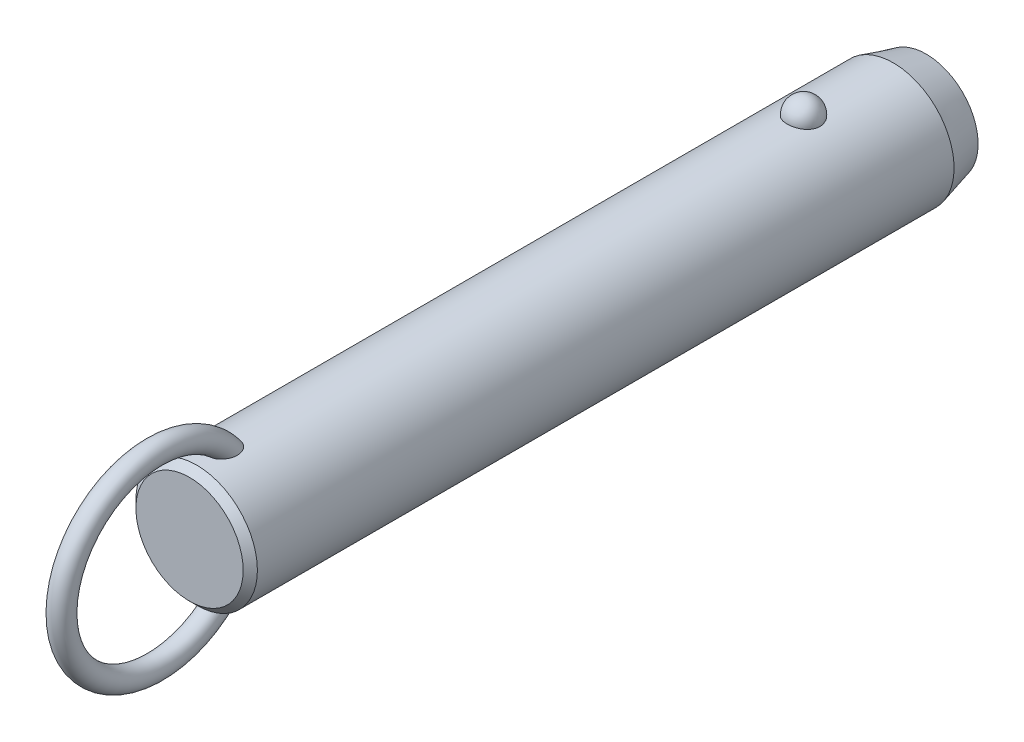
ISO-10303-21;
HEADER;
FILE_DESCRIPTION(('STEP AP214'),'2;1');
FILE_NAME('part.step','',(''),(''),'','','');
FILE_SCHEMA(('AUTOMOTIVE_DESIGN { 1 0 10303 214 1 1 1 1 }'));
ENDSEC;
DATA;
#1=APPLICATION_CONTEXT('core data for automotive mechanical design processes');
#2=APPLICATION_PROTOCOL_DEFINITION('international standard','automotive_design',2000,#1);
#3=PRODUCT_CONTEXT('',#1,'mechanical');
#4=PRODUCT('Part','Part','',(#3));
#5=PRODUCT_RELATED_PRODUCT_CATEGORY('part','',(#4));
#6=PRODUCT_DEFINITION_FORMATION('','',#4);
#7=PRODUCT_DEFINITION_CONTEXT('part definition',#1,'design');
#8=PRODUCT_DEFINITION('design','',#6,#7);
#9=PRODUCT_DEFINITION_SHAPE('','',#8);
#10=(LENGTH_UNIT() NAMED_UNIT(*) SI_UNIT(.MILLI.,.METRE.));
#11=(NAMED_UNIT(*) PLANE_ANGLE_UNIT() SI_UNIT($,.RADIAN.));
#12=(NAMED_UNIT(*) SI_UNIT($,.STERADIAN.) SOLID_ANGLE_UNIT());
#13=UNCERTAINTY_MEASURE_WITH_UNIT(LENGTH_MEASURE(1.E-05),#10,'distance_accuracy_value','');
#14=(GEOMETRIC_REPRESENTATION_CONTEXT(3) GLOBAL_UNCERTAINTY_ASSIGNED_CONTEXT((#13)) GLOBAL_UNIT_ASSIGNED_CONTEXT((#10,
#11,#12)) REPRESENTATION_CONTEXT('',''));
#15=CARTESIAN_POINT('',(0.,0.,0.));
#16=DIRECTION('',(0.,0.,1.));
#17=DIRECTION('',(1.,0.,0.));
#18=AXIS2_PLACEMENT_3D('',#15,#16,#17);
#19=CARTESIAN_POINT('',(0.,0.,96.5));
#20=DIRECTION('',(0.,0.,-1.));
#21=DIRECTION('',(-1.,0.,0.));
#22=AXIS2_PLACEMENT_3D('',#19,#20,#21);
#23=CYLINDRICAL_SURFACE('',#22,11.1);
#24=CARTESIAN_POINT('',(2.9724815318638,10.6945945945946,-3.));
#25=CARTESIAN_POINT('',(2.9724783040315,10.6945972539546,-2.83225059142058));
#26=CARTESIAN_POINT('',(2.95876598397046,10.6984356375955,-2.66445972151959));
#27=CARTESIAN_POINT('',(2.90424529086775,10.7133624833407,-2.33362381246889));
#28=CARTESIAN_POINT('',(2.8634252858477,10.7244540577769,-2.1705808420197));
#29=CARTESIAN_POINT('',(2.75573657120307,10.7526272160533,-1.85396767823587));
#30=CARTESIAN_POINT('',(2.68887937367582,10.7697061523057,-1.70039333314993));
#31=CARTESIAN_POINT('',(2.53079696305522,10.8079438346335,-1.40691598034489));
#32=CARTESIAN_POINT('',(2.43957264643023,10.8291024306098,-1.2670124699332));
#33=CARTESIAN_POINT('',(2.23458150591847,10.8732541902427,-1.00409565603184));
#34=CARTESIAN_POINT('',(2.12071295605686,10.8962553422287,-0.881162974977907));
#35=CARTESIAN_POINT('',(1.87365402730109,10.9414421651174,-0.656352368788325));
#36=CARTESIAN_POINT('',(1.74046358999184,10.9636278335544,-0.554474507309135));
#37=CARTESIAN_POINT('',(1.45872188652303,11.0046495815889,-0.374872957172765));
#38=CARTESIAN_POINT('',(1.31021276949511,11.0234944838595,-0.297085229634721));
#39=CARTESIAN_POINT('',(1.00170030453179,11.0557957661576,-0.167529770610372));
#40=CARTESIAN_POINT('',(0.841698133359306,11.0692526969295,-0.115759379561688));
#41=CARTESIAN_POINT('',(0.517607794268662,11.0890932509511,-0.0403925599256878));
#42=CARTESIAN_POINT('',(0.353633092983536,11.0955916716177,-0.0163383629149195));
#43=CARTESIAN_POINT('',(0.0238420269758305,11.1011989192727,0.00445177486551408));
#44=CARTESIAN_POINT('',(-0.141974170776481,11.1003084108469,0.0011901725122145));
#45=CARTESIAN_POINT('',(-0.46840517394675,11.0912990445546,-0.0323233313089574));
#46=CARTESIAN_POINT('',(-0.629059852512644,11.0832767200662,-0.062214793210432));
#47=CARTESIAN_POINT('',(-0.942937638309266,11.0609962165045,-0.147645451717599));
#48=CARTESIAN_POINT('',(-1.09616062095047,11.0467379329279,-0.203185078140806));
#49=CARTESIAN_POINT('',(-1.39181061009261,11.0134071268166,-0.338752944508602));
#50=CARTESIAN_POINT('',(-1.53417383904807,10.9943086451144,-0.418913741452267));
#51=CARTESIAN_POINT('',(-1.80342160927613,10.9533667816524,-0.601448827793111));
#52=CARTESIAN_POINT('',(-1.9303046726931,10.9315231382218,-0.703825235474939));
#53=CARTESIAN_POINT('',(-2.16747598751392,10.887005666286,-0.930091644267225));
#54=CARTESIAN_POINT('',(-2.27742774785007,10.8643239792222,-1.05433291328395));
#55=CARTESIAN_POINT('',(-2.47517316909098,10.8209886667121,-1.31966633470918));
#56=CARTESIAN_POINT('',(-2.56296538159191,10.8003351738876,-1.46075958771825));
#57=CARTESIAN_POINT('',(-2.71500300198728,10.7631304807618,-1.75753646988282));
#58=CARTESIAN_POINT('',(-2.77898901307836,10.7466250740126,-1.91335887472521));
#59=CARTESIAN_POINT('',(-2.88046189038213,10.7198747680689,-2.2339152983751));
#60=CARTESIAN_POINT('',(-2.91794947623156,10.709629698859,-2.39864907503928));
#61=CARTESIAN_POINT('',(-2.96537819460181,10.6965949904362,-2.73165170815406));
#62=CARTESIAN_POINT('',(-2.97542891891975,10.693775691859,-2.89990378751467));
#63=CARTESIAN_POINT('',(-2.96804271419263,10.6958279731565,-3.235752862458));
#64=CARTESIAN_POINT('',(-2.95060646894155,10.7006993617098,-3.40334987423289));
#65=CARTESIAN_POINT('',(-2.88883358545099,10.71753912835,-3.73233906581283));
#66=CARTESIAN_POINT('',(-2.84462026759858,10.7294749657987,-3.89375610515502));
#67=CARTESIAN_POINT('',(-2.73050447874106,10.7590797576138,-4.20667949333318));
#68=CARTESIAN_POINT('',(-2.66060103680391,10.7767489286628,-4.35818546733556));
#69=CARTESIAN_POINT('',(-2.49642559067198,10.8159599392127,-4.6478542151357));
#70=CARTESIAN_POINT('',(-2.40203047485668,10.8375211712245,-4.78594458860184));
#71=CARTESIAN_POINT('',(-2.19143488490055,10.8820570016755,-5.0441038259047));
#72=CARTESIAN_POINT('',(-2.07523364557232,10.9050316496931,-5.16417205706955));
#73=CARTESIAN_POINT('',(-1.82361254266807,10.9499219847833,-5.38334833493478));
#74=CARTESIAN_POINT('',(-1.68812945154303,10.9718338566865,-5.4823846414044));
#75=CARTESIAN_POINT('',(-1.40191298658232,11.0120611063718,-5.65618873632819));
#76=CARTESIAN_POINT('',(-1.25118062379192,11.0303767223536,-5.73095813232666));
#77=CARTESIAN_POINT('',(-0.940570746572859,11.0611653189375,-5.85334725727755));
#78=CARTESIAN_POINT('',(-0.780821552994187,11.0737044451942,-5.90127578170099));
#79=CARTESIAN_POINT('',(-0.455204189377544,11.0918598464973,-5.96992976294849));
#80=CARTESIAN_POINT('',(-0.289336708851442,11.0974768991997,-5.99065827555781));
#81=CARTESIAN_POINT('',(0.0406846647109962,11.1011307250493,-6.00418773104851));
#82=CARTESIAN_POINT('',(0.204817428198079,11.099299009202,-5.99747318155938));
#83=CARTESIAN_POINT('',(0.529553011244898,11.088551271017,-5.9574031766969));
#84=CARTESIAN_POINT('',(0.690155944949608,11.0796354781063,-5.92404858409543));
#85=CARTESIAN_POINT('',(1.0027760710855,11.0557204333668,-5.83180084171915));
#86=CARTESIAN_POINT('',(1.15482001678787,11.0407414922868,-5.77299291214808));
#87=CARTESIAN_POINT('',(1.44678373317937,11.0062913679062,-5.63147366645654));
#88=CARTESIAN_POINT('',(1.58670279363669,10.9868199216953,-5.54876095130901));
#89=CARTESIAN_POINT('',(1.8527023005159,10.9451315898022,-5.36027644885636));
#90=CARTESIAN_POINT('',(1.97855158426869,10.9228788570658,-5.25418644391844));
#91=CARTESIAN_POINT('',(2.21080872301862,10.8782509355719,-5.02251354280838));
#92=CARTESIAN_POINT('',(2.31721312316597,10.8558757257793,-4.89692718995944));
#93=CARTESIAN_POINT('',(2.50945517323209,10.8130715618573,-4.62745408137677));
#94=CARTESIAN_POINT('',(2.59493284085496,10.7926798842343,-4.48330448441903));
#95=CARTESIAN_POINT('',(2.740862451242,10.7565495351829,-4.18236358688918));
#96=CARTESIAN_POINT('',(2.80132490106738,10.7408089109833,-4.02557762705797));
#97=CARTESIAN_POINT('',(2.88959070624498,10.7173718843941,-3.72475308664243));
#98=CARTESIAN_POINT('',(2.92062102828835,10.7088950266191,-3.58171216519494));
#99=CARTESIAN_POINT('',(2.96206765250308,10.6975052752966,-3.29245795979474));
#100=CARTESIAN_POINT('',(2.97248434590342,10.6945922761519,-3.14624473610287));
#101=CARTESIAN_POINT('',(2.9724815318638,10.6945945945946,-3.));
#102=B_SPLINE_CURVE_WITH_KNOTS('',3,(#24,#25,#26,#27,#28,#29,#30,#31,#32,#33,#34,#35,#36,#37,
#38,#39,#40,#41,#42,#43,#44,#45,#46,#47,#48,#49,#50,#51,#52,#53,#54,#55,#56,#57,#58,#59,#60,#61,
#62,#63,#64,#65,#66,#67,#68,#69,#70,#71,#72,#73,#74,#75,#76,#77,#78,#79,#80,#81,#82,#83,#84,#85,
#86,#87,#88,#89,#90,#91,#92,#93,#94,#95,#96,#97,#98,#99,#100,#101),.UNSPECIFIED.,.T.,.F.,(4,2,2,
2,2,2,2,2,2,2,2,2,2,2,2,2,2,2,2,2,2,2,2,2,2,2,2,2,2,2,2,2,2,2,2,2,2,2,4),(0.,0.502722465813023,
1.00566079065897,1.5083769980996,2.01107471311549,2.51608392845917,3.02109467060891,
3.52475118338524,4.02835620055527,4.52351860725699,5.01863647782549,5.50715297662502,
5.99567766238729,6.48688002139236,6.97812923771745,7.47814366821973,7.97819077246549,
8.48353712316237,8.98886974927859,9.49218093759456,9.99547960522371,10.4964777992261,
10.997494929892,11.5010810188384,12.0046847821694,12.5099796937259,13.0152411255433,
13.5145635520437,14.0138298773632,14.5043200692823,14.9947943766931,15.4836390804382,
15.9725123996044,16.4685040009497,16.9645836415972,17.4686765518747,17.972557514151,
18.410841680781,18.849117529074),.UNSPECIFIED.);
#103=CARTESIAN_POINT('',(2.9724815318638,10.6945945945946,-3.));
#104=VERTEX_POINT('',#103);
#105=EDGE_CURVE('E41',#104,#104,#102,.T.);
#106=ORIENTED_EDGE('',*,*,#105,.T.);
#107=EDGE_LOOP('',(#106));
#108=FACE_BOUND('',#107,.T.);
#109=CARTESIAN_POINT('',(0.,0.,107.9));
#110=DIRECTION('',(0.,0.,1.));
#111=DIRECTION('',(1.,0.,0.));
#112=AXIS2_PLACEMENT_3D('',#109,#110,#111);
#113=CIRCLE('',#112,11.1);
#114=CARTESIAN_POINT('',(11.1,0.,107.9));
#115=VERTEX_POINT('',#114);
#116=EDGE_CURVE('E10',#115,#115,#113,.F.);
#117=ORIENTED_EDGE('',*,*,#116,.T.);
#118=EDGE_LOOP('',(#117));
#119=FACE_BOUND('',#118,.T.);
#120=CARTESIAN_POINT('',(-0.564520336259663,-11.0856356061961,100.157815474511));
#121=CARTESIAN_POINT('',(-0.667202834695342,-11.0804062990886,100.191283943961));
#122=CARTESIAN_POINT('',(-0.766875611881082,-11.0738877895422,100.233835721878));
#123=CARTESIAN_POINT('',(-0.957284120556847,-11.0590576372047,100.335419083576));
#124=CARTESIAN_POINT('',(-1.04801616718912,-11.0507452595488,100.39445742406));
#125=CARTESIAN_POINT('',(-1.21800952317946,-11.0333016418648,100.526529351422));
#126=CARTESIAN_POINT('',(-1.29730805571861,-11.0241732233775,100.599515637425));
#127=CARTESIAN_POINT('',(-1.44337665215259,-11.0060026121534,100.757037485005));
#128=CARTESIAN_POINT('',(-1.51014622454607,-10.9969604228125,100.841573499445));
#129=CARTESIAN_POINT('',(-1.63454620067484,-10.9791841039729,101.025521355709));
#130=CARTESIAN_POINT('',(-1.69127003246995,-10.9705107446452,101.125549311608));
#131=CARTESIAN_POINT('',(-1.78980785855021,-10.9548648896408,101.332790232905));
#132=CARTESIAN_POINT('',(-1.83161214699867,-10.9478935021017,101.440007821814));
#133=CARTESIAN_POINT('',(-1.91557028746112,-10.9335803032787,101.705408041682));
#134=CARTESIAN_POINT('',(-1.95040620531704,-10.9273269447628,101.865980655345));
#135=CARTESIAN_POINT('',(-1.99388326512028,-10.9194709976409,102.190697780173));
#136=CARTESIAN_POINT('',(-2.00248051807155,-10.9178762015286,102.354847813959));
#137=CARTESIAN_POINT('',(-1.99551615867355,-10.9191578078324,102.724650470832));
#138=CARTESIAN_POINT('',(-1.9732206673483,-10.9232807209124,102.930191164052));
#139=CARTESIAN_POINT('',(-1.91529761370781,-10.9335244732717,103.233595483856));
#140=CARTESIAN_POINT('',(-1.8918457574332,-10.9376266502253,103.334088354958));
#141=CARTESIAN_POINT('',(-1.83700674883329,-10.9469720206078,103.532855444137));
#142=CARTESIAN_POINT('',(-1.80562070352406,-10.9522150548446,103.631129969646));
#143=CARTESIAN_POINT('',(-1.73463055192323,-10.9636837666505,103.825914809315));
#144=CARTESIAN_POINT('',(-1.69493416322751,-10.9699202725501,103.922390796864));
#145=CARTESIAN_POINT('',(-1.60745141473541,-10.9830806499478,104.111626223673));
#146=CARTESIAN_POINT('',(-1.55966150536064,-10.9900048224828,104.204384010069));
#147=CARTESIAN_POINT('',(-1.45591812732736,-11.0042280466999,104.384690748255));
#148=CARTESIAN_POINT('',(-1.40000013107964,-11.0115253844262,104.472260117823));
#149=CARTESIAN_POINT('',(-1.27937470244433,-11.0261911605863,104.641029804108));
#150=CARTESIAN_POINT('',(-1.21467835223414,-11.0335594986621,104.72223795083));
#151=CARTESIAN_POINT('',(-1.08218150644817,-11.0473027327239,104.869001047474));
#152=CARTESIAN_POINT('',(-1.01522633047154,-11.0537063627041,104.935309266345));
#153=CARTESIAN_POINT('',(-0.87295215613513,-11.065850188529,105.058378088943));
#154=CARTESIAN_POINT('',(-0.797642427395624,-11.0715911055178,105.115149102));
#155=CARTESIAN_POINT('',(-0.651396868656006,-11.081071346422,105.207515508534));
#156=CARTESIAN_POINT('',(-0.581712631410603,-11.0849841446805,105.245049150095));
#157=CARTESIAN_POINT('',(-0.437066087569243,-11.0916271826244,105.308259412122));
#158=CARTESIAN_POINT('',(-0.362109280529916,-11.0943586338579,105.333948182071));
#159=CARTESIAN_POINT('',(-0.207828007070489,-11.0983242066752,105.371117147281));
#160=CARTESIAN_POINT('',(-0.128467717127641,-11.0995432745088,105.382454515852));
#161=CARTESIAN_POINT('',(0.0309101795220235,-11.1002423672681,105.388965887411));
#162=CARTESIAN_POINT('',(0.110927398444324,-11.0997233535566,105.384148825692));
#163=CARTESIAN_POINT('',(0.256406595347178,-11.097240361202,105.360959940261));
#164=CARTESIAN_POINT('',(0.32223577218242,-11.0955074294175,105.344754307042));
#165=CARTESIAN_POINT('',(0.450635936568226,-11.0910350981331,105.302600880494));
#166=CARTESIAN_POINT('',(0.513205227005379,-11.0882951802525,105.276648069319));
#167=CARTESIAN_POINT('',(0.662626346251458,-11.0805620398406,105.202607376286));
#168=CARTESIAN_POINT('',(0.747127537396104,-11.0751144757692,105.149845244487));
#169=CARTESIAN_POINT('',(0.906756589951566,-11.0631932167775,105.031720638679));
#170=CARTESIAN_POINT('',(0.981859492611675,-11.0567168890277,104.966325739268));
#171=CARTESIAN_POINT('',(1.10712207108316,-11.0447856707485,104.84226337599));
#172=CARTESIAN_POINT('',(1.15909566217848,-11.0394280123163,104.785383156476));
#173=CARTESIAN_POINT('',(1.25791923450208,-11.0286040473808,104.667327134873));
#174=CARTESIAN_POINT('',(1.30476642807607,-11.0231376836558,104.606149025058));
#175=CARTESIAN_POINT('',(1.43818612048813,-11.0068027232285,104.417305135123));
#176=CARTESIAN_POINT('',(1.51751767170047,-10.9960104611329,104.284453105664));
#177=CARTESIAN_POINT('',(1.63597546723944,-10.9788847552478,104.053137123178));
#178=CARTESIAN_POINT('',(1.67988876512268,-10.9722190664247,103.957053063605));
#179=CARTESIAN_POINT('',(1.75953241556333,-10.9597298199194,103.761431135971));
#180=CARTESIAN_POINT('',(1.79525967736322,-10.9539065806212,103.661891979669));
#181=CARTESIAN_POINT('',(1.85844731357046,-10.9433632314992,103.46021118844));
#182=CARTESIAN_POINT('',(1.88591073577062,-10.9386427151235,103.35807052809));
#183=CARTESIAN_POINT('',(1.93234324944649,-10.9305350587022,103.151819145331));
#184=CARTESIAN_POINT('',(1.95131065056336,-10.9271481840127,103.047708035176));
#185=CARTESIAN_POINT('',(1.99040203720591,-10.9201183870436,102.765458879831));
#186=CARTESIAN_POINT('',(2.00221217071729,-10.9179256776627,102.586037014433));
#187=CARTESIAN_POINT('',(1.99711676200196,-10.9188636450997,102.227713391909));
#188=CARTESIAN_POINT('',(1.98026150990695,-10.9219849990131,102.048811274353));
#189=CARTESIAN_POINT('',(1.92151657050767,-10.9324473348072,101.73645144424));
#190=CARTESIAN_POINT('',(1.88605081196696,-10.9386915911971,101.601759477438));
#191=CARTESIAN_POINT('',(1.7939302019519,-10.9541780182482,101.339966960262));
#192=CARTESIAN_POINT('',(1.73729868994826,-10.9634168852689,101.212858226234));
#193=CARTESIAN_POINT('',(1.612370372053,-10.9824218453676,100.989418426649));
#194=CARTESIAN_POINT('',(1.54715374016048,-10.9918945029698,100.891345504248));
#195=CARTESIAN_POINT('',(1.40127026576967,-11.0114415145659,100.707434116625));
#196=CARTESIAN_POINT('',(1.32060742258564,-11.0215157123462,100.621592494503));
#197=CARTESIAN_POINT('',(1.14474787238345,-11.041168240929,100.465163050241));
#198=CARTESIAN_POINT('',(1.04947805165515,-11.0507437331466,100.394656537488));
#199=CARTESIAN_POINT('',(0.847278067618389,-11.0680789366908,100.272640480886));
#200=CARTESIAN_POINT('',(0.740351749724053,-11.0758392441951,100.221124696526));
#201=CARTESIAN_POINT('',(0.52928931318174,-11.0878275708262,100.143485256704));
#202=CARTESIAN_POINT('',(0.425895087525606,-11.0923259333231,100.115377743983));
#203=CARTESIAN_POINT('',(0.215723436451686,-11.0984001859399,100.077703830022));
#204=CARTESIAN_POINT('',(0.108947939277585,-11.0999777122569,100.068127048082));
#205=CARTESIAN_POINT('',(-0.0938962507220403,-11.1000196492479,100.067877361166));
#206=CARTESIAN_POINT('',(-0.189967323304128,-11.0987797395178,100.075408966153));
#207=CARTESIAN_POINT('',(-0.379657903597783,-11.0939111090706,100.105507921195));
#208=CARTESIAN_POINT('',(-0.473277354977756,-11.0902823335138,100.128075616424));
#209=CARTESIAN_POINT('',(-0.564520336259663,-11.0856356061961,100.157815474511));
#210=B_SPLINE_CURVE_WITH_KNOTS('',3,(#120,#121,#122,#123,#124,#125,#126,#127,#128,#129,#130,
#131,#132,#133,#134,#135,#136,#137,#138,#139,#140,#141,#142,#143,#144,#145,#146,#147,#148,#149,
#150,#151,#152,#153,#154,#155,#156,#157,#158,#159,#160,#161,#162,#163,#164,#165,#166,#167,#168,
#169,#170,#171,#172,#173,#174,#175,#176,#177,#178,#179,#180,#181,#182,#183,#184,#185,#186,#187,
#188,#189,#190,#191,#192,#193,#194,#195,#196,#197,#198,#199,#200,#201,#202,#203,#204,#205,#206,
#207,#208,#209),.UNSPECIFIED.,.T.,.F.,(4,2,2,2,2,2,2,2,2,2,2,2,2,2,2,2,2,2,2,2,2,2,2,2,2,2,2,2,
2,2,2,2,2,2,2,2,2,2,2,2,2,2,2,2,4),(0.,0.323999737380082,0.648132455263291,0.971184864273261,
1.29424994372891,1.63886237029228,1.98369857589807,2.47426059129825,2.96564271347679,
3.58257396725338,3.89215258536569,4.20168803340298,4.51486273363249,4.82817514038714,
5.14015911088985,5.45175282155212,5.73442856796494,6.01679375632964,6.25364580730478,
6.49025437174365,6.7291996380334,6.96801276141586,7.17061258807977,7.37331685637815,
7.67094989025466,7.96935728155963,8.20075067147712,8.43226927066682,8.89581623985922,
9.21306533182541,9.53043400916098,9.84768549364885,10.1650000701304,10.70229304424,
11.2386443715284,11.6553390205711,12.0715755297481,12.4245637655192,12.7774607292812,
13.1321855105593,13.4867936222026,13.8068771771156,14.1267813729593,14.4146787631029,
14.7025827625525),.UNSPECIFIED.);
#211=CARTESIAN_POINT('',(-0.564520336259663,-11.0856356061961,100.157815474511));
#212=VERTEX_POINT('',#211);
#213=EDGE_CURVE('E58',#212,#212,#210,.T.);
#214=ORIENTED_EDGE('',*,*,#213,.T.);
#215=EDGE_LOOP('',(#214));
#216=FACE_BOUND('',#215,.T.);
#217=CARTESIAN_POINT('',(-0.564520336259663,11.0856356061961,100.157815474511));
#218=CARTESIAN_POINT('',(-0.468542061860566,11.0905203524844,100.126545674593));
#219=CARTESIAN_POINT('',(-0.36979381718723,11.0942886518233,100.103157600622));
#220=CARTESIAN_POINT('',(-0.169555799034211,11.0991586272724,100.073085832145));
#221=CARTESIAN_POINT('',(-0.0680604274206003,11.1002543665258,100.06643932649));
#222=CARTESIAN_POINT('',(0.134549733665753,11.099646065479,100.070157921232));
#223=CARTESIAN_POINT('',(0.235664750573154,11.0979441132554,100.08051033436));
#224=CARTESIAN_POINT('',(0.434632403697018,11.0919342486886,100.117831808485));
#225=CARTESIAN_POINT('',(0.53248665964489,11.0876276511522,100.144792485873));
#226=CARTESIAN_POINT('',(0.722445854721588,11.0768742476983,100.2144096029));
#227=CARTESIAN_POINT('',(0.814543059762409,11.0704246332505,100.257086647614));
#228=CARTESIAN_POINT('',(0.990565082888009,11.0560659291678,100.356648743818));
#229=CARTESIAN_POINT('',(1.07448844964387,11.048156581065,100.413536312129));
#230=CARTESIAN_POINT('',(1.23562672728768,11.0313221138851,100.542210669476));
#231=CARTESIAN_POINT('',(1.31242684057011,11.0223686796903,100.614511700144));
#232=CARTESIAN_POINT('',(1.45398030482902,11.0045918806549,100.770042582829));
#233=CARTESIAN_POINT('',(1.51873073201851,10.9957685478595,100.853275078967));
#234=CARTESIAN_POINT('',(1.64107232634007,10.9782087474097,101.036384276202));
#235=CARTESIAN_POINT('',(1.69743176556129,10.9695572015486,101.137089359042));
#236=CARTESIAN_POINT('',(1.79515063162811,10.9539887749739,101.345626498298));
#237=CARTESIAN_POINT('',(1.83649966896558,10.9470730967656,101.45346343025));
#238=CARTESIAN_POINT('',(1.91931148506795,10.9329211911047,101.720399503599));
#239=CARTESIAN_POINT('',(1.9534010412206,10.9267904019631,101.881861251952));
#240=CARTESIAN_POINT('',(1.99526195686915,10.9192174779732,102.20821631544));
#241=CARTESIAN_POINT('',(2.00298989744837,10.9177830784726,102.37311484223));
#242=CARTESIAN_POINT('',(1.99396251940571,10.9194420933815,102.744100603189));
#243=CARTESIAN_POINT('',(1.97050829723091,10.923774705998,102.95003871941));
#244=CARTESIAN_POINT('',(1.91079643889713,10.9343131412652,103.253901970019));
#245=CARTESIAN_POINT('',(1.88673702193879,10.9385106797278,103.354529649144));
#246=CARTESIAN_POINT('',(1.83065508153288,10.9480376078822,103.553510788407));
#247=CARTESIAN_POINT('',(1.79863369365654,10.9533668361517,103.651864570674));
#248=CARTESIAN_POINT('',(1.72633365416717,10.9649954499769,103.846720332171));
#249=CARTESIAN_POINT('',(1.68596409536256,10.9713053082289,103.94318790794));
#250=CARTESIAN_POINT('',(1.59707998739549,10.9845964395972,104.132323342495));
#251=CARTESIAN_POINT('',(1.54856169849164,10.9915780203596,104.224989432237));
#252=CARTESIAN_POINT('',(1.44330168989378,11.0058935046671,104.404975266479));
#253=CARTESIAN_POINT('',(1.38659749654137,11.0132257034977,104.492316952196));
#254=CARTESIAN_POINT('',(1.26431158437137,11.0279330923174,104.660456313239));
#255=CARTESIAN_POINT('',(1.19874160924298,11.0353082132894,104.741262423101));
#256=CARTESIAN_POINT('',(1.06542088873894,11.0489310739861,104.885985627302));
#257=CARTESIAN_POINT('',(0.998640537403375,11.0552153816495,104.950784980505));
#258=CARTESIAN_POINT('',(0.856896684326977,11.0671032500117,105.070846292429));
#259=CARTESIAN_POINT('',(0.781942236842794,11.0727075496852,105.126118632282));
#260=CARTESIAN_POINT('',(0.636276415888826,11.081949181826,105.215972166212));
#261=CARTESIAN_POINT('',(0.566755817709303,11.0857572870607,105.252441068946));
#262=CARTESIAN_POINT('',(0.422602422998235,11.0921860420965,105.313533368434));
#263=CARTESIAN_POINT('',(0.347974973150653,11.0948079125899,105.338168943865));
#264=CARTESIAN_POINT('',(0.194593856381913,11.0985608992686,105.373323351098));
#265=CARTESIAN_POINT('',(0.115807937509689,11.0996777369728,105.383706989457));
#266=CARTESIAN_POINT('',(-0.0422499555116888,11.1002003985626,105.388574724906));
#267=CARTESIAN_POINT('',(-0.121521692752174,11.09960699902,105.383066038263));
#268=CARTESIAN_POINT('',(-0.266046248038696,11.0970123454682,105.358827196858));
#269=CARTESIAN_POINT('',(-0.331661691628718,11.0952283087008,105.342135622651));
#270=CARTESIAN_POINT('',(-0.459588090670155,11.0906663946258,105.299111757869));
#271=CARTESIAN_POINT('',(-0.521897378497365,11.0878880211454,105.272774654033));
#272=CARTESIAN_POINT('',(-0.671446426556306,11.0800342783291,105.197513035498));
#273=CARTESIAN_POINT('',(-0.756250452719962,11.0744969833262,105.143818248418));
#274=CARTESIAN_POINT('',(-0.916349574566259,11.0624045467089,105.023802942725));
#275=CARTESIAN_POINT('',(-0.99161892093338,11.0558467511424,104.957449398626));
#276=CARTESIAN_POINT('',(-1.11713140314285,11.0437783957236,104.831633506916));
#277=CARTESIAN_POINT('',(-1.16920539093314,11.0383619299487,104.773952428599));
#278=CARTESIAN_POINT('',(-1.26817476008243,11.02743010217,104.654280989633));
#279=CARTESIAN_POINT('',(-1.31506731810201,11.0219146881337,104.592288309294));
#280=CARTESIAN_POINT('',(-1.40399813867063,11.0109399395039,104.464784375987));
#281=CARTESIAN_POINT('',(-1.4460286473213,11.0054807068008,104.399267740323));
#282=CARTESIAN_POINT('',(-1.52538779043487,10.9947621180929,104.265422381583));
#283=CARTESIAN_POINT('',(-1.56271516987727,10.9895028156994,104.197092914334));
#284=CARTESIAN_POINT('',(-1.64537943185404,10.9774790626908,104.033210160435));
#285=CARTESIAN_POINT('',(-1.68879497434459,10.9708503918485,103.9366735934));
#286=CARTESIAN_POINT('',(-1.76740738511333,10.9584602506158,103.740236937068));
#287=CARTESIAN_POINT('',(-1.80260120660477,10.95269910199,103.64033561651));
#288=CARTESIAN_POINT('',(-1.86468657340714,10.9423003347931,103.437966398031));
#289=CARTESIAN_POINT('',(-1.8915816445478,10.9376622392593,103.335499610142));
#290=CARTESIAN_POINT('',(-1.93682458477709,10.9297405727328,103.128642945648));
#291=CARTESIAN_POINT('',(-1.9551708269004,10.9264572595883,103.024252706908));
#292=CARTESIAN_POINT('',(-1.99232562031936,10.9197647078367,102.74262876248));
#293=CARTESIAN_POINT('',(-2.00294603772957,10.9177914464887,102.564185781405));
#294=CARTESIAN_POINT('',(-1.99566675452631,10.9191290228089,102.207996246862));
#295=CARTESIAN_POINT('',(-1.97781651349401,10.9224306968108,102.03024902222));
#296=CARTESIAN_POINT('',(-1.91747214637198,10.9331592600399,101.719792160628));
#297=CARTESIAN_POINT('',(-1.88131022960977,10.9395108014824,101.585825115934));
#298=CARTESIAN_POINT('',(-1.7879038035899,10.9551659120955,101.32559757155));
#299=CARTESIAN_POINT('',(-1.7306830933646,10.9644661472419,101.199328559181));
#300=CARTESIAN_POINT('',(-1.60475573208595,10.9835398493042,100.97741565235));
#301=CARTESIAN_POINT('',(-1.53908879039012,10.9930297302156,100.880026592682));
#302=CARTESIAN_POINT('',(-1.39238608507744,11.0125708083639,100.697525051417));
#303=CARTESIAN_POINT('',(-1.31135150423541,11.0226219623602,100.612411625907));
#304=CARTESIAN_POINT('',(-1.14382035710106,11.0411991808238,100.46529943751));
#305=CARTESIAN_POINT('',(-1.05858500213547,11.0497792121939,100.40186930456));
#306=CARTESIAN_POINT('',(-0.878723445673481,11.0655285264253,100.290250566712));
#307=CARTESIAN_POINT('',(-0.784123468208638,11.0727015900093,100.242020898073));
#308=CARTESIAN_POINT('',(-0.646163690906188,11.0812501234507,100.186023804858));
#309=CARTESIAN_POINT('',(-0.605595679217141,11.0835451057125,100.171197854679));
#310=CARTESIAN_POINT('',(-0.564520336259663,11.0856356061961,100.157815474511));
#311=B_SPLINE_CURVE_WITH_KNOTS('',3,(#217,#218,#219,#220,#221,#222,#223,#224,#225,#226,#227,
#228,#229,#230,#231,#232,#233,#234,#235,#236,#237,#238,#239,#240,#241,#242,#243,#244,#245,#246,
#247,#248,#249,#250,#251,#252,#253,#254,#255,#256,#257,#258,#259,#260,#261,#262,#263,#264,#265,
#266,#267,#268,#269,#270,#271,#272,#273,#274,#275,#276,#277,#278,#279,#280,#281,#282,#283,#284,
#285,#286,#287,#288,#289,#290,#291,#292,#293,#294,#295,#296,#297,#298,#299,#300,#301,#302,#303,
#304,#305,#306,#307,#308,#309,#310),.UNSPECIFIED.,.T.,.F.,(4,2,2,2,2,2,2,2,2,2,2,2,2,2,2,2,2,2,
2,2,2,2,2,2,2,2,2,2,2,2,2,2,2,2,2,2,2,2,2,2,2,2,2,2,2,2,4),(0.,0.303061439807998,
0.606795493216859,0.910302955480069,1.21365733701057,1.51741085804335,1.82121821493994,
2.13745205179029,2.45376252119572,2.79958678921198,3.14564996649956,3.63832391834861,
4.13180893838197,4.75031912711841,5.06071926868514,5.37107516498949,5.68500772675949,
5.99908475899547,6.31176519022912,6.62403542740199,6.90315673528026,7.1819719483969,
7.41687778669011,7.65154134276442,7.88841587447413,8.12518286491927,8.3275284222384,
8.52997509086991,8.82986421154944,9.13054668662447,9.36393502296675,9.59744991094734,
9.83133221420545,10.0652767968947,10.383032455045,10.7009056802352,11.0186436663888,
11.3364420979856,11.8705925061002,12.4038159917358,12.8189662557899,13.2336487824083,
13.5857049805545,13.9377340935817,14.2561354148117,14.5736690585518,14.7033687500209),.UNSPECIFIED.);
#312=CARTESIAN_POINT('',(-0.564520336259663,11.0856356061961,100.157815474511));
#313=VERTEX_POINT('',#312);
#314=EDGE_CURVE('E66',#313,#313,#311,.T.);
#315=ORIENTED_EDGE('',*,*,#314,.T.);
#316=EDGE_LOOP('',(#315));
#317=FACE_BOUND('',#316,.T.);
#318=CARTESIAN_POINT('',(0.,0.,-19.3999999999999));
#319=DIRECTION('',(0.,0.,-1.));
#320=DIRECTION('',(-1.,0.,0.));
#321=AXIS2_PLACEMENT_3D('',#318,#319,#320);
#322=CIRCLE('',#321,11.1);
#323=CARTESIAN_POINT('',(-11.1,0.,-19.3999999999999));
#324=VERTEX_POINT('',#323);
#325=EDGE_CURVE('E55',#324,#324,#322,.F.);
#326=ORIENTED_EDGE('',*,*,#325,.T.);
#327=EDGE_LOOP('',(#326));
#328=FACE_BOUND('',#327,.T.);
#329=ADVANCED_FACE('F37',(#108,#119,#216,#317,#328),#23,.T.);
#330=CARTESIAN_POINT('',(0.,0.,-25.4));
#331=DIRECTION('',(0.,0.,-1.));
#332=DIRECTION('',(-1.,0.,0.));
#333=AXIS2_PLACEMENT_3D('',#330,#331,#332);
#334=PLANE('',#333);
#335=CARTESIAN_POINT('',(0.,0.,-25.4));
#336=DIRECTION('',(0.,0.,-1.));
#337=DIRECTION('',(-1.,0.,0.));
#338=AXIS2_PLACEMENT_3D('',#335,#336,#337);
#339=CIRCLE('',#338,9.49230484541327);
#340=CARTESIAN_POINT('',(-9.49230484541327,0.,-25.4));
#341=VERTEX_POINT('',#340);
#342=EDGE_CURVE('E65',#341,#341,#339,.T.);
#343=ORIENTED_EDGE('',*,*,#342,.T.);
#344=EDGE_LOOP('',(#343));
#345=FACE_BOUND('',#344,.T.);
#346=ADVANCED_FACE('F84',(#345),#334,.T.);
#347=CARTESIAN_POINT('',(0.,0.,-25.4));
#348=DIRECTION('',(0.,0.,1.));
#349=DIRECTION('',(1.,0.,0.));
#350=AXIS2_PLACEMENT_3D('',#347,#348,#349);
#351=CONICAL_SURFACE('',#350,9.49230484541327,0.261799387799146);
#352=ORIENTED_EDGE('',*,*,#325,.F.);
#353=EDGE_LOOP('',(#352));
#354=FACE_BOUND('',#353,.T.);
#355=ORIENTED_EDGE('',*,*,#342,.F.);
#356=EDGE_LOOP('',(#355));
#357=FACE_BOUND('',#356,.T.);
#358=ADVANCED_FACE('F82',(#354,#357),#351,.T.);
#359=CARTESIAN_POINT('',(0.,0.,109.2));
#360=DIRECTION('',(0.,0.,1.));
#361=DIRECTION('',(1.,0.,0.));
#362=AXIS2_PLACEMENT_3D('',#359,#360,#361);
#363=PLANE('',#362);
#364=CARTESIAN_POINT('',(0.,0.,109.2));
#365=DIRECTION('',(0.,0.,1.));
#366=DIRECTION('',(1.,0.,0.));
#367=AXIS2_PLACEMENT_3D('',#364,#365,#366);
#368=CIRCLE('',#367,9.79999999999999);
#369=CARTESIAN_POINT('',(9.79999999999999,0.,109.2));
#370=VERTEX_POINT('',#369);
#371=EDGE_CURVE('E50',#370,#370,#368,.T.);
#372=ORIENTED_EDGE('',*,*,#371,.T.);
#373=EDGE_LOOP('',(#372));
#374=FACE_BOUND('',#373,.T.);
#375=ADVANCED_FACE('F76',(#374),#363,.T.);
#376=CARTESIAN_POINT('',(0.,0.,115.55));
#377=DIRECTION('',(1.,0.,0.));
#378=DIRECTION('',(0.,0.,-1.));
#379=AXIS2_PLACEMENT_3D('',#376,#377,#378);
#380=TOROIDAL_SURFACE('',#379,17.05,2.);
#381=ORIENTED_EDGE('',*,*,#314,.F.);
#382=EDGE_LOOP('',(#381));
#383=FACE_BOUND('',#382,.T.);
#384=ORIENTED_EDGE('',*,*,#213,.F.);
#385=EDGE_LOOP('',(#384));
#386=FACE_BOUND('',#385,.T.);
#387=ADVANCED_FACE('F72',(#383,#386),#380,.T.);
#388=CARTESIAN_POINT('',(0.,0.,109.2));
#389=DIRECTION('',(0.,0.,-1.));
#390=DIRECTION('',(-1.,0.,0.));
#391=AXIS2_PLACEMENT_3D('',#388,#389,#390);
#392=CONICAL_SURFACE('',#391,9.79999999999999,0.785398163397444);
#393=ORIENTED_EDGE('',*,*,#116,.F.);
#394=EDGE_LOOP('',(#393));
#395=FACE_BOUND('',#394,.T.);
#396=ORIENTED_EDGE('',*,*,#371,.F.);
#397=EDGE_LOOP('',(#396));
#398=FACE_BOUND('',#397,.T.);
#399=ADVANCED_FACE('F39',(#395,#398),#392,.T.);
#400=CARTESIAN_POINT('',(0.,11.1,-3.));
#401=DIRECTION('',(0.,1.,0.));
#402=DIRECTION('',(0.,0.,-1.));
#403=AXIS2_PLACEMENT_3D('',#400,#401,#402);
#404=SPHERICAL_SURFACE('',#403,3.);
#405=ORIENTED_EDGE('',*,*,#105,.F.);
#406=EDGE_LOOP('',(#405));
#407=FACE_BOUND('',#406,.T.);
#408=ADVANCED_FACE('F78',(#407),#404,.T.);
#409=CLOSED_SHELL('',(#329,#346,#358,#375,#387,#399,#408));
#410=MANIFOLD_SOLID_BREP('B2',#409);
#411=ADVANCED_BREP_SHAPE_REPRESENTATION('',(#18,#410),#14);
#412=SHAPE_DEFINITION_REPRESENTATION(#9,#411);
ENDSEC;
END-ISO-10303-21;
